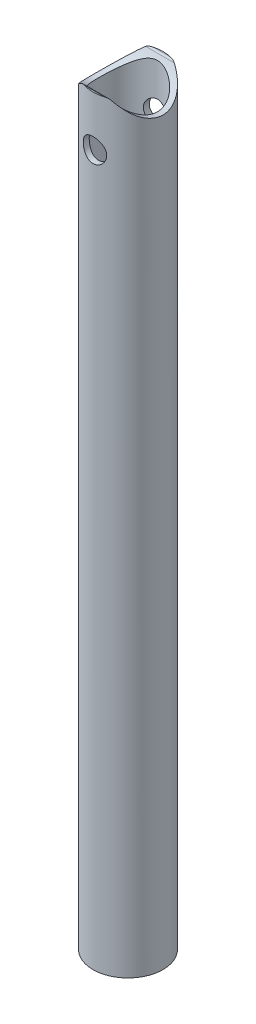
from build123d import *

# Parameters (mm, degrees)
AUFSATZ_LINEAR_AUSTRAGEN1_DEPTH      = 40
AUFSATZ_LINEAR_AUSTRAGEN1_DEPTH_BACK = 310
SKIZZE1_R                            = 15.8
SKIZZE1_R_2                          = 13.3
SCHNITT_LINEAR_AUSTRAGEN2_DEPTH      = 177.916731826
SCHNITT_LINEAR_AUSTRAGEN2_DEPTH_BACK = 177.916731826
SCHNITT_LINEAR_AUSTRAGEN3_DEPTH      = 177.916731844
SCHNITT_LINEAR_AUSTRAGEN3_DEPTH_BACK = 177.916731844
SKIZZE3_R                            = 5.3


with BuildPart() as part:
    # Skizze1 → Aufsatz-Linear austragen1 (new, two sides: drawn at the far end of the back side and taken through both)
    with BuildSketch(Plane(origin=(0, 134.5, 0), x_dir=(1, 0, 0), z_dir=(0, 1, 0)).offset(-AUFSATZ_LINEAR_AUSTRAGEN1_DEPTH_BACK)):
        with Locations(Location((0, 0, 0), (0, 0, 270))):
            Circle(SKIZZE1_R)
        with Locations(Location((0, 0, 0), (0, 0, 270))):
            Circle(SKIZZE1_R_2, mode=Mode.SUBTRACT)
    extrude(amount=AUFSATZ_LINEAR_AUSTRAGEN1_DEPTH + AUFSATZ_LINEAR_AUSTRAGEN1_DEPTH_BACK)

    # Skizze2 → Schnitt-Linear austragen2 (cut, two sides: drawn at the far end of the back side and taken through both)
    with BuildSketch(Plane(origin=(0, 0, 0), x_dir=(0, 0, -1), z_dir=(1, 0, 0)).offset(-SCHNITT_LINEAR_AUSTRAGEN2_DEPTH_BACK)):
        with BuildLine():
            Line((-15.303943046, 167.5), (-25.006884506, 167.5))
            ThreePointArc((-25.006884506, 167.5), (-32.077952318, 170.428932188), (-35.006884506, 177.5))
            Line((-35.006884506, 177.5), (-35.006884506, 197.5))
            ThreePointArc((-35.006884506, 197.5), (-32.077952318, 204.571067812), (-25.006884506, 207.5))
            Line((-25.006884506, 207.5), (24.993115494, 207.5))
            ThreePointArc((24.993115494, 207.5), (32.064183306, 204.571067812), (34.993115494, 197.5))
            Line((34.993115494, 197.5), (34.993115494, 177.5))
            ThreePointArc((34.993115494, 177.5), (32.064183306, 170.428932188), (24.993115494, 167.5))
            Line((24.993115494, 167.5), (15.290174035, 167.5))
            ThreePointArc((15.290174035, 167.5), (14.783081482, 167.361891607), (14.416056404, 166.985714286))
            ThreePointArc((14.416056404, 166.985714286), (-0.006884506, 158.5), (-14.429825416, 166.985714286))
            ThreePointArc((-14.429825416, 166.985714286), (-14.796850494, 167.361891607), (-15.303943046, 167.5))
        make_face()
    extrude(amount=SCHNITT_LINEAR_AUSTRAGEN2_DEPTH + SCHNITT_LINEAR_AUSTRAGEN2_DEPTH_BACK, mode=Mode.SUBTRACT)

    # Skizze3 → Schnitt-Linear austragen3 (cut, two sides: drawn at the far end of the back side and taken through both)
    with BuildSketch(Plane.XY.offset(-SCHNITT_LINEAR_AUSTRAGEN3_DEPTH_BACK)):
        with Locations((0, 144.8)):
            Circle(SKIZZE3_R)
    extrude(amount=SCHNITT_LINEAR_AUSTRAGEN3_DEPTH + SCHNITT_LINEAR_AUSTRAGEN3_DEPTH_BACK, mode=Mode.SUBTRACT)


solid = part.part
